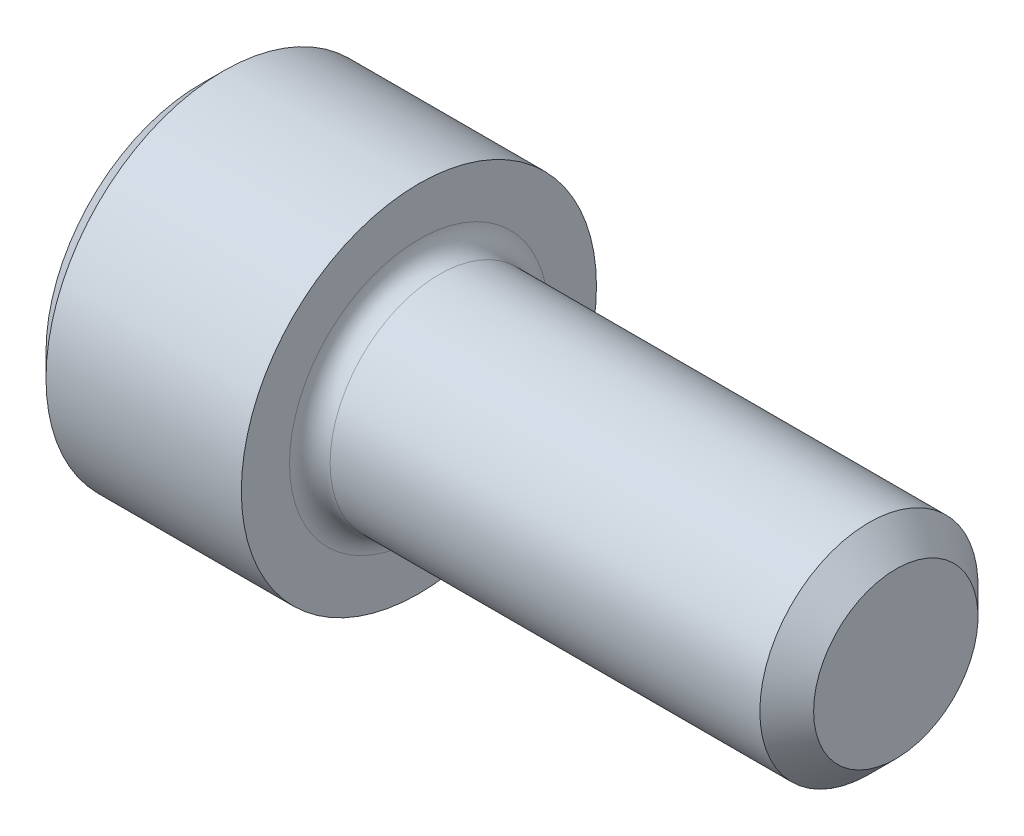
from build123d import *

# Parameters (mm, degrees)
FILLET1_R   = 0.2032
HEX_2_DEPTH = 0.9652


with BuildPart() as part:
    # BodySke → Base-Revolve (revolve)
    with BuildSketch(Plane.XY, mode=Mode.PRIVATE) as base_revolve_sk:
        Polygon((0, 0), (0, 1.5494), (0.2286, 1.778), (2.1844, 1.778), (2.1844, 1.0922), (6.69036, 1.0922), (6.9596, 0.82296), (6.9596, 0), align=None)
    revolve(base_revolve_sk.sketch.rotate(Axis((-31.75, 0, 0), (1, 0, 0)), 90), axis=Axis((-31.75, 0, 0), (1, 0, 0)))

    # Fillet1
    fillet1_edges = [part.edges().sort_by_distance(p)[0] for p in [
        (2.1844, 0, -1.0922),
    ]]
    fillet(fillet1_edges, radius=FILLET1_R)

    # Sketch2 → Hex-PreBroach (revolve, cut)
    with BuildSketch(Plane.XY, mode=Mode.PRIVATE) as hex_prebroach_sk:
        Polygon((0, 0.9906), (0.9652, 0.9906), (1.537123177, 0), (0, 0), align=None)
    revolve(hex_prebroach_sk.sketch.rotate(Axis((0, 0, 0), (1, 0, 0)), 90), axis=Axis((0, 0, 0), (1, 0, 0)), mode=Mode.SUBTRACT)

    # Sketch3 → Hex 2 (cut)
    with BuildSketch(Plane(origin=(0, 0, 0), x_dir=(0, 0.500000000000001, 0.866025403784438), z_dir=(-1, 0, 0))):
        Polygon((0.571923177, 0.9906), (-0.571923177, 0.9906), (-1.143846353, 0), (-0.571923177, -0.9906), (0.571923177, -0.9906), (1.143846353, 0), align=None)
    extrude(amount=-HEX_2_DEPTH, mode=Mode.SUBTRACT)


solid = part.part
